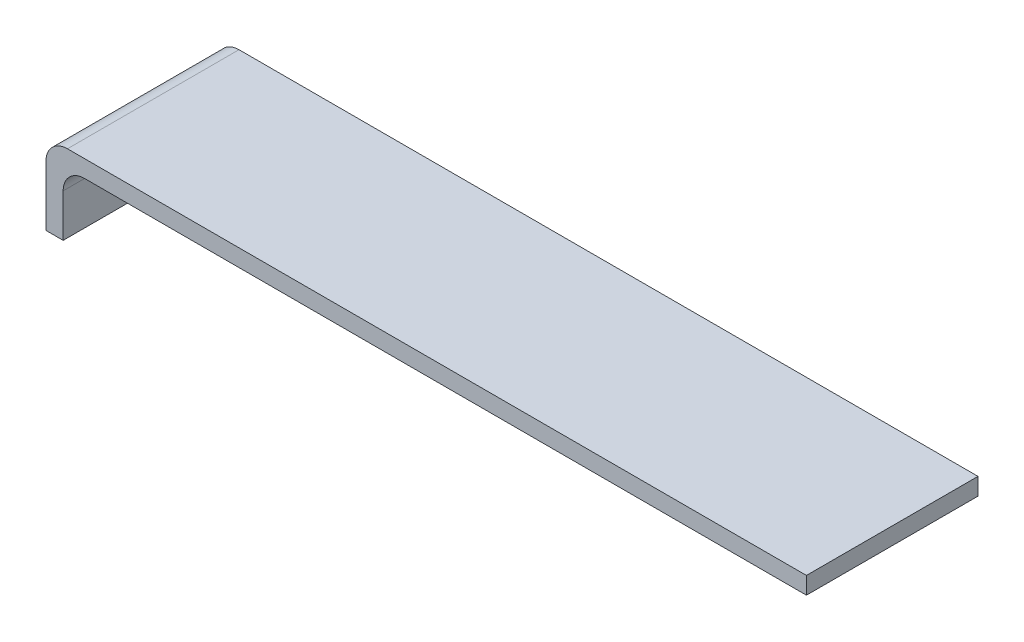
ISO-10303-21;
HEADER;
FILE_DESCRIPTION(('STEP AP214'),'2;1');
FILE_NAME('part.step','',(''),(''),'','','');
FILE_SCHEMA(('AUTOMOTIVE_DESIGN { 1 0 10303 214 1 1 1 1 }'));
ENDSEC;
DATA;
#1=APPLICATION_CONTEXT('core data for automotive mechanical design processes');
#2=APPLICATION_PROTOCOL_DEFINITION('international standard','automotive_design',2000,#1);
#3=PRODUCT_CONTEXT('',#1,'mechanical');
#4=PRODUCT('Part','Part','',(#3));
#5=PRODUCT_RELATED_PRODUCT_CATEGORY('part','',(#4));
#6=PRODUCT_DEFINITION_FORMATION('','',#4);
#7=PRODUCT_DEFINITION_CONTEXT('part definition',#1,'design');
#8=PRODUCT_DEFINITION('design','',#6,#7);
#9=PRODUCT_DEFINITION_SHAPE('','',#8);
#10=(LENGTH_UNIT() NAMED_UNIT(*) SI_UNIT(.MILLI.,.METRE.));
#11=(NAMED_UNIT(*) PLANE_ANGLE_UNIT() SI_UNIT($,.RADIAN.));
#12=(NAMED_UNIT(*) SI_UNIT($,.STERADIAN.) SOLID_ANGLE_UNIT());
#13=UNCERTAINTY_MEASURE_WITH_UNIT(LENGTH_MEASURE(1.E-05),#10,'distance_accuracy_value','');
#14=(GEOMETRIC_REPRESENTATION_CONTEXT(3) GLOBAL_UNCERTAINTY_ASSIGNED_CONTEXT((#13)) GLOBAL_UNIT_ASSIGNED_CONTEXT((#10,
#11,#12)) REPRESENTATION_CONTEXT('',''));
#15=CARTESIAN_POINT('',(0.,0.,0.));
#16=DIRECTION('',(0.,0.,1.));
#17=DIRECTION('',(1.,0.,0.));
#18=AXIS2_PLACEMENT_3D('',#15,#16,#17);
#19=CARTESIAN_POINT('',(-24.3559720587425,0.353975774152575,0.));
#20=DIRECTION('',(-1.,0.,0.));
#21=DIRECTION('',(0.,0.,1.));
#22=AXIS2_PLACEMENT_3D('',#19,#20,#21);
#23=PLANE('',#22);
#24=DIRECTION('',(0.,0.,1.));
#25=VECTOR('',#24,1.);
#26=CARTESIAN_POINT('',(-24.3559720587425,-1.14602422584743,2.));
#27=LINE('',#26,#25);
#28=CARTESIAN_POINT('',(-24.3559720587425,-1.14602422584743,0.));
#29=VERTEX_POINT('',#28);
#30=CARTESIAN_POINT('',(-24.3559720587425,-1.14602422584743,4.));
#31=VERTEX_POINT('',#30);
#32=EDGE_CURVE('E153',#29,#31,#27,.T.);
#33=ORIENTED_EDGE('',*,*,#32,.T.);
#34=DIRECTION('',(0.,1.,0.));
#35=VECTOR('',#34,1.);
#36=CARTESIAN_POINT('',(-24.3559720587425,0.353975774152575,4.));
#37=LINE('',#36,#35);
#38=CARTESIAN_POINT('',(-24.3559720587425,0.253975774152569,4.));
#39=VERTEX_POINT('',#38);
#40=EDGE_CURVE('E154',#31,#39,#37,.T.);
#41=ORIENTED_EDGE('',*,*,#40,.T.);
#42=DIRECTION('',(0.,0.,1.));
#43=VECTOR('',#42,1.);
#44=CARTESIAN_POINT('',(-24.3559720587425,0.253975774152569,0.));
#45=LINE('',#44,#43);
#46=CARTESIAN_POINT('',(-24.3559720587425,0.253975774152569,0.));
#47=VERTEX_POINT('',#46);
#48=EDGE_CURVE('E145',#47,#39,#45,.T.);
#49=ORIENTED_EDGE('',*,*,#48,.F.);
#50=DIRECTION('',(0.,1.,0.));
#51=VECTOR('',#50,1.);
#52=CARTESIAN_POINT('',(-24.3559720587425,0.353975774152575,0.));
#53=LINE('',#52,#51);
#54=EDGE_CURVE('E199',#47,#29,#53,.F.);
#55=ORIENTED_EDGE('',*,*,#54,.T.);
#56=EDGE_LOOP('',(#33,#41,#49,#55));
#57=FACE_BOUND('',#56,.T.);
#58=ADVANCED_FACE('F34',(#57),#23,.T.);
#59=CARTESIAN_POINT('',(-24.1559720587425,-1.14602422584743,2.));
#60=DIRECTION('',(0.,1.,0.));
#61=DIRECTION('',(-1.,0.,0.));
#62=AXIS2_PLACEMENT_3D('',#59,#60,#61);
#63=PLANE('',#62);
#64=DIRECTION('',(-1.,0.,0.));
#65=VECTOR('',#64,1.);
#66=CARTESIAN_POINT('',(-24.1559720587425,-1.14602422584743,4.));
#67=LINE('',#66,#65);
#68=CARTESIAN_POINT('',(-23.9559720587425,-1.14602422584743,4.));
#69=VERTEX_POINT('',#68);
#70=EDGE_CURVE('E157',#31,#69,#67,.F.);
#71=ORIENTED_EDGE('',*,*,#70,.F.);
#72=ORIENTED_EDGE('',*,*,#32,.F.);
#73=DIRECTION('',(-1.,0.,0.));
#74=VECTOR('',#73,1.);
#75=CARTESIAN_POINT('',(-24.1559720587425,-1.14602422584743,0.));
#76=LINE('',#75,#74);
#77=CARTESIAN_POINT('',(-23.9559720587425,-1.14602422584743,0.));
#78=VERTEX_POINT('',#77);
#79=EDGE_CURVE('E151',#78,#29,#76,.T.);
#80=ORIENTED_EDGE('',*,*,#79,.F.);
#81=DIRECTION('',(0.,0.,-1.));
#82=VECTOR('',#81,1.);
#83=CARTESIAN_POINT('',(-23.9559720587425,-1.14602422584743,4.));
#84=LINE('',#83,#82);
#85=EDGE_CURVE('E102',#69,#78,#84,.T.);
#86=ORIENTED_EDGE('',*,*,#85,.F.);
#87=EDGE_LOOP('',(#71,#72,#80,#86));
#88=FACE_BOUND('',#87,.T.);
#89=ADVANCED_FACE('F182',(#88),#63,.F.);
#90=CARTESIAN_POINT('',(-23.8559720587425,0.253975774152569,0.));
#91=DIRECTION('',(0.,0.,1.));
#92=DIRECTION('',(1.,0.,0.));
#93=AXIS2_PLACEMENT_3D('',#90,#91,#92);
#94=CYLINDRICAL_SURFACE('',#93,0.5);
#95=CARTESIAN_POINT('',(-23.8559720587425,0.253975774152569,0.));
#96=DIRECTION('',(0.,0.,1.));
#97=DIRECTION('',(0.,1.,0.));
#98=AXIS2_PLACEMENT_3D('',#95,#96,#97);
#99=CIRCLE('',#98,0.5);
#100=CARTESIAN_POINT('',(-23.8559720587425,0.753975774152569,0.));
#101=VERTEX_POINT('',#100);
#102=EDGE_CURVE('E167',#101,#47,#99,.T.);
#103=ORIENTED_EDGE('',*,*,#102,.T.);
#104=ORIENTED_EDGE('',*,*,#48,.T.);
#105=CARTESIAN_POINT('',(-23.8559720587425,0.253975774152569,4.));
#106=DIRECTION('',(0.,0.,-1.));
#107=DIRECTION('',(-1.,0.,0.));
#108=AXIS2_PLACEMENT_3D('',#105,#106,#107);
#109=CIRCLE('',#108,0.5);
#110=CARTESIAN_POINT('',(-23.8559720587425,0.753975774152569,4.));
#111=VERTEX_POINT('',#110);
#112=EDGE_CURVE('E159',#39,#111,#109,.T.);
#113=ORIENTED_EDGE('',*,*,#112,.T.);
#114=DIRECTION('',(0.,0.,1.));
#115=VECTOR('',#114,1.);
#116=CARTESIAN_POINT('',(-23.8559720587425,0.753975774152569,0.));
#117=LINE('',#116,#115);
#118=EDGE_CURVE('E105',#101,#111,#117,.T.);
#119=ORIENTED_EDGE('',*,*,#118,.F.);
#120=EDGE_LOOP('',(#103,#104,#113,#119));
#121=FACE_BOUND('',#120,.T.);
#122=ADVANCED_FACE('F173',(#121),#94,.T.);
#123=CARTESIAN_POINT('',(-23.9559720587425,0.353975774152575,4.));
#124=DIRECTION('',(1.,0.,0.));
#125=DIRECTION('',(0.,0.,-1.));
#126=AXIS2_PLACEMENT_3D('',#123,#124,#125);
#127=PLANE('',#126);
#128=ORIENTED_EDGE('',*,*,#85,.T.);
#129=DIRECTION('',(0.,1.,0.));
#130=VECTOR('',#129,1.);
#131=CARTESIAN_POINT('',(-23.9559720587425,0.353975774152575,0.));
#132=LINE('',#131,#130);
#133=CARTESIAN_POINT('',(-23.9559720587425,-0.146024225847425,0.));
#134=VERTEX_POINT('',#133);
#135=EDGE_CURVE('E95',#78,#134,#132,.T.);
#136=ORIENTED_EDGE('',*,*,#135,.T.);
#137=DIRECTION('',(0.,0.,-1.));
#138=VECTOR('',#137,1.);
#139=CARTESIAN_POINT('',(-23.9559720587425,-0.146024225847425,2.));
#140=LINE('',#139,#138);
#141=CARTESIAN_POINT('',(-23.9559720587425,-0.146024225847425,4.));
#142=VERTEX_POINT('',#141);
#143=EDGE_CURVE('E99',#134,#142,#140,.F.);
#144=ORIENTED_EDGE('',*,*,#143,.T.);
#145=DIRECTION('',(0.,1.,0.));
#146=VECTOR('',#145,1.);
#147=CARTESIAN_POINT('',(-23.9559720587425,0.353975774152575,4.));
#148=LINE('',#147,#146);
#149=EDGE_CURVE('E143',#142,#69,#148,.F.);
#150=ORIENTED_EDGE('',*,*,#149,.T.);
#151=EDGE_LOOP('',(#128,#136,#144,#150));
#152=FACE_BOUND('',#151,.T.);
#153=ADVANCED_FACE('F97',(#152),#127,.T.);
#154=CARTESIAN_POINT('',(-24.3559720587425,0.753975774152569,0.));
#155=DIRECTION('',(0.,1.,0.));
#156=DIRECTION('',(-1.,0.,0.));
#157=AXIS2_PLACEMENT_3D('',#154,#155,#156);
#158=PLANE('',#157);
#159=DIRECTION('',(0.,0.,-1.));
#160=VECTOR('',#159,1.);
#161=CARTESIAN_POINT('',(-6.62748427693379,0.753975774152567,0.));
#162=LINE('',#161,#160);
#163=CARTESIAN_POINT('',(-6.62748427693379,0.753975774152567,0.));
#164=VERTEX_POINT('',#163);
#165=CARTESIAN_POINT('',(-6.62748427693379,0.753975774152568,4.));
#166=VERTEX_POINT('',#165);
#167=EDGE_CURVE('E120',#164,#166,#162,.F.);
#168=ORIENTED_EDGE('',*,*,#167,.F.);
#169=DIRECTION('',(1.,0.,0.));
#170=VECTOR('',#169,1.);
#171=CARTESIAN_POINT('',(-15.4917281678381,0.753975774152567,0.));
#172=LINE('',#171,#170);
#173=EDGE_CURVE('E119',#164,#101,#172,.F.);
#174=ORIENTED_EDGE('',*,*,#173,.T.);
#175=ORIENTED_EDGE('',*,*,#118,.T.);
#176=DIRECTION('',(1.,0.,0.));
#177=VECTOR('',#176,1.);
#178=CARTESIAN_POINT('',(-15.4917281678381,0.753975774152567,4.));
#179=LINE('',#178,#177);
#180=EDGE_CURVE('E206',#166,#111,#179,.F.);
#181=ORIENTED_EDGE('',*,*,#180,.F.);
#182=EDGE_LOOP('',(#168,#174,#175,#181));
#183=FACE_BOUND('',#182,.T.);
#184=ADVANCED_FACE('F222',(#183),#158,.T.);
#185=CARTESIAN_POINT('',(-23.4559720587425,-0.146024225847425,2.));
#186=DIRECTION('',(0.,0.,-1.));
#187=DIRECTION('',(-1.,0.,0.));
#188=AXIS2_PLACEMENT_3D('',#185,#186,#187);
#189=CYLINDRICAL_SURFACE('',#188,0.5);
#190=ORIENTED_EDGE('',*,*,#143,.F.);
#191=CARTESIAN_POINT('',(-23.4559720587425,-0.146024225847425,0.));
#192=DIRECTION('',(0.,0.,-1.));
#193=DIRECTION('',(-1.,0.,0.));
#194=AXIS2_PLACEMENT_3D('',#191,#192,#193);
#195=CIRCLE('',#194,0.5);
#196=CARTESIAN_POINT('',(-23.4559720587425,0.353975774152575,0.));
#197=VERTEX_POINT('',#196);
#198=EDGE_CURVE('E37',#134,#197,#195,.T.);
#199=ORIENTED_EDGE('',*,*,#198,.T.);
#200=DIRECTION('',(0.,0.,1.));
#201=VECTOR('',#200,1.);
#202=CARTESIAN_POINT('',(-23.4559720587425,0.353975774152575,0.));
#203=LINE('',#202,#201);
#204=CARTESIAN_POINT('',(-23.4559720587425,0.353975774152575,4.));
#205=VERTEX_POINT('',#204);
#206=EDGE_CURVE('E217',#205,#197,#203,.F.);
#207=ORIENTED_EDGE('',*,*,#206,.F.);
#208=CARTESIAN_POINT('',(-23.4559720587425,-0.146024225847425,4.));
#209=DIRECTION('',(0.,0.,-1.));
#210=DIRECTION('',(-1.,0.,0.));
#211=AXIS2_PLACEMENT_3D('',#208,#209,#210);
#212=CIRCLE('',#211,0.5);
#213=EDGE_CURVE('E112',#142,#205,#212,.T.);
#214=ORIENTED_EDGE('',*,*,#213,.F.);
#215=EDGE_LOOP('',(#190,#199,#207,#214));
#216=FACE_BOUND('',#215,.T.);
#217=ADVANCED_FACE('F109',(#216),#189,.F.);
#218=CARTESIAN_POINT('',(-15.4917281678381,0.55397577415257,0.));
#219=DIRECTION('',(0.,0.,1.));
#220=DIRECTION('',(1.,0.,0.));
#221=AXIS2_PLACEMENT_3D('',#218,#219,#220);
#222=PLANE('',#221);
#223=ORIENTED_EDGE('',*,*,#173,.F.);
#224=DIRECTION('',(0.,1.,0.));
#225=VECTOR('',#224,1.);
#226=CARTESIAN_POINT('',(-6.62748427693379,0.753975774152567,0.));
#227=LINE('',#226,#225);
#228=CARTESIAN_POINT('',(-6.62748427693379,0.353975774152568,0.));
#229=VERTEX_POINT('',#228);
#230=EDGE_CURVE('E126',#229,#164,#227,.T.);
#231=ORIENTED_EDGE('',*,*,#230,.F.);
#232=DIRECTION('',(1.,0.,0.));
#233=VECTOR('',#232,1.);
#234=CARTESIAN_POINT('',(-6.62748427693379,0.353975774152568,0.));
#235=LINE('',#234,#233);
#236=EDGE_CURVE('E117',#197,#229,#235,.T.);
#237=ORIENTED_EDGE('',*,*,#236,.F.);
#238=ORIENTED_EDGE('',*,*,#198,.F.);
#239=ORIENTED_EDGE('',*,*,#135,.F.);
#240=ORIENTED_EDGE('',*,*,#79,.T.);
#241=ORIENTED_EDGE('',*,*,#54,.F.);
#242=ORIENTED_EDGE('',*,*,#102,.F.);
#243=EDGE_LOOP('',(#223,#231,#237,#238,#239,#240,#241,#242));
#244=FACE_BOUND('',#243,.T.);
#245=ADVANCED_FACE('F115',(#244),#222,.F.);
#246=CARTESIAN_POINT('',(-6.62748427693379,0.753975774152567,0.));
#247=DIRECTION('',(1.,0.,0.));
#248=DIRECTION('',(0.,0.,-1.));
#249=AXIS2_PLACEMENT_3D('',#246,#247,#248);
#250=PLANE('',#249);
#251=ORIENTED_EDGE('',*,*,#167,.T.);
#252=DIRECTION('',(0.,1.,0.));
#253=VECTOR('',#252,1.);
#254=CARTESIAN_POINT('',(-6.62748427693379,0.55397577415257,4.));
#255=LINE('',#254,#253);
#256=CARTESIAN_POINT('',(-6.62748427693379,0.35397577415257,4.));
#257=VERTEX_POINT('',#256);
#258=EDGE_CURVE('E52',#257,#166,#255,.T.);
#259=ORIENTED_EDGE('',*,*,#258,.F.);
#260=DIRECTION('',(0.,0.,1.));
#261=VECTOR('',#260,1.);
#262=CARTESIAN_POINT('',(-6.62748427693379,0.353975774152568,0.));
#263=LINE('',#262,#261);
#264=EDGE_CURVE('E43',#229,#257,#263,.T.);
#265=ORIENTED_EDGE('',*,*,#264,.F.);
#266=ORIENTED_EDGE('',*,*,#230,.T.);
#267=EDGE_LOOP('',(#251,#259,#265,#266));
#268=FACE_BOUND('',#267,.T.);
#269=ADVANCED_FACE('F250',(#268),#250,.T.);
#270=CARTESIAN_POINT('',(-15.4917281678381,0.55397577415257,4.));
#271=DIRECTION('',(0.,0.,1.));
#272=DIRECTION('',(1.,0.,0.));
#273=AXIS2_PLACEMENT_3D('',#270,#271,#272);
#274=PLANE('',#273);
#275=ORIENTED_EDGE('',*,*,#258,.T.);
#276=ORIENTED_EDGE('',*,*,#180,.T.);
#277=ORIENTED_EDGE('',*,*,#112,.F.);
#278=ORIENTED_EDGE('',*,*,#40,.F.);
#279=ORIENTED_EDGE('',*,*,#70,.T.);
#280=ORIENTED_EDGE('',*,*,#149,.F.);
#281=ORIENTED_EDGE('',*,*,#213,.T.);
#282=DIRECTION('',(1.,0.,0.));
#283=VECTOR('',#282,1.);
#284=CARTESIAN_POINT('',(-6.62748427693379,0.353975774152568,4.));
#285=LINE('',#284,#283);
#286=EDGE_CURVE('E11',#257,#205,#285,.F.);
#287=ORIENTED_EDGE('',*,*,#286,.F.);
#288=EDGE_LOOP('',(#275,#276,#277,#278,#279,#280,#281,#287));
#289=FACE_BOUND('',#288,.T.);
#290=ADVANCED_FACE('F225',(#289),#274,.T.);
#291=CARTESIAN_POINT('',(-6.62748427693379,0.353975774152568,0.));
#292=DIRECTION('',(0.,-1.,0.));
#293=DIRECTION('',(1.,0.,0.));
#294=AXIS2_PLACEMENT_3D('',#291,#292,#293);
#295=PLANE('',#294);
#296=ORIENTED_EDGE('',*,*,#264,.T.);
#297=ORIENTED_EDGE('',*,*,#286,.T.);
#298=ORIENTED_EDGE('',*,*,#206,.T.);
#299=ORIENTED_EDGE('',*,*,#236,.T.);
#300=EDGE_LOOP('',(#296,#297,#298,#299));
#301=FACE_BOUND('',#300,.T.);
#302=ADVANCED_FACE('F228',(#301),#295,.T.);
#303=CLOSED_SHELL('',(#58,#89,#122,#153,#184,#217,#245,#269,#290,#302));
#304=MANIFOLD_SOLID_BREP('B2',#303);
#305=ADVANCED_BREP_SHAPE_REPRESENTATION('',(#18,#304),#14);
#306=SHAPE_DEFINITION_REPRESENTATION(#9,#305);
ENDSEC;
END-ISO-10303-21;
